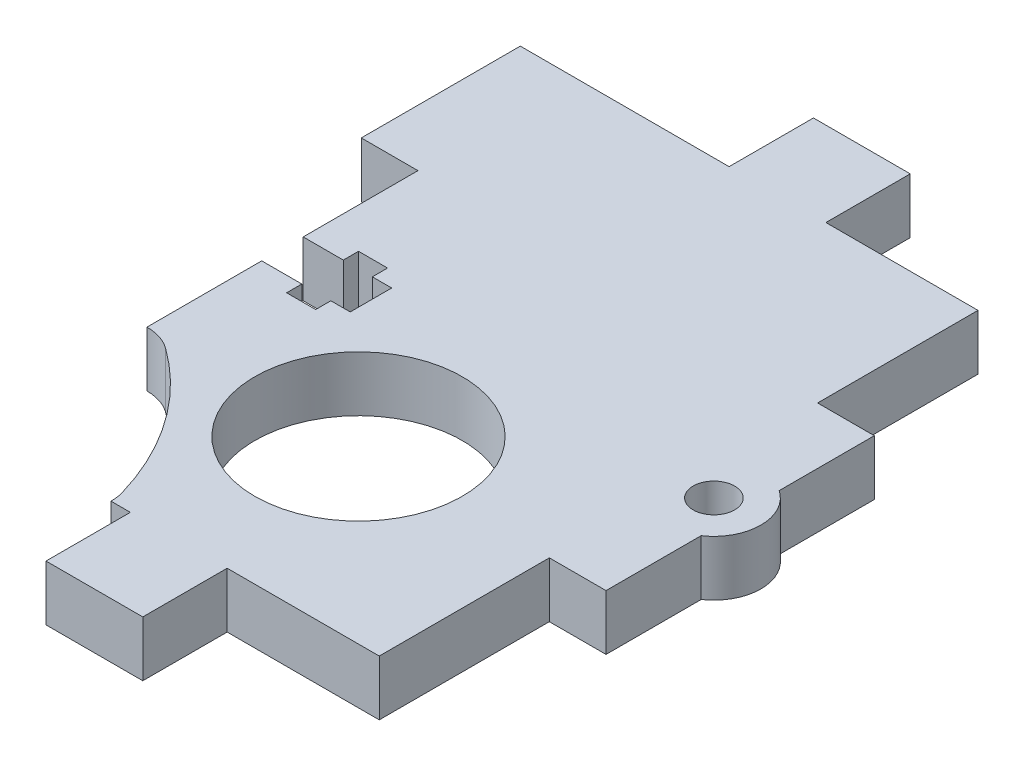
ISO-10303-21;
HEADER;
FILE_DESCRIPTION(('STEP AP214'),'2;1');
FILE_NAME('part.step','',(''),(''),'','','');
FILE_SCHEMA(('AUTOMOTIVE_DESIGN { 1 0 10303 214 1 1 1 1 }'));
ENDSEC;
DATA;
#1=APPLICATION_CONTEXT('core data for automotive mechanical design processes');
#2=APPLICATION_PROTOCOL_DEFINITION('international standard','automotive_design',2000,#1);
#3=PRODUCT_CONTEXT('',#1,'mechanical');
#4=PRODUCT('Part','Part','',(#3));
#5=PRODUCT_RELATED_PRODUCT_CATEGORY('part','',(#4));
#6=PRODUCT_DEFINITION_FORMATION('','',#4);
#7=PRODUCT_DEFINITION_CONTEXT('part definition',#1,'design');
#8=PRODUCT_DEFINITION('design','',#6,#7);
#9=PRODUCT_DEFINITION_SHAPE('','',#8);
#10=(LENGTH_UNIT() NAMED_UNIT(*) SI_UNIT(.MILLI.,.METRE.));
#11=(NAMED_UNIT(*) PLANE_ANGLE_UNIT() SI_UNIT($,.RADIAN.));
#12=(NAMED_UNIT(*) SI_UNIT($,.STERADIAN.) SOLID_ANGLE_UNIT());
#13=UNCERTAINTY_MEASURE_WITH_UNIT(LENGTH_MEASURE(1.E-05),#10,'distance_accuracy_value','');
#14=(GEOMETRIC_REPRESENTATION_CONTEXT(3) GLOBAL_UNCERTAINTY_ASSIGNED_CONTEXT((#13)) GLOBAL_UNIT_ASSIGNED_CONTEXT((#10,
#11,#12)) REPRESENTATION_CONTEXT('',''));
#15=CARTESIAN_POINT('',(0.,0.,0.));
#16=DIRECTION('',(0.,0.,1.));
#17=DIRECTION('',(1.,0.,0.));
#18=AXIS2_PLACEMENT_3D('',#15,#16,#17);
#19=CARTESIAN_POINT('',(-9.5,-2.,-2.6));
#20=DIRECTION('',(-1.,0.,0.));
#21=DIRECTION('',(0.,0.,1.));
#22=AXIS2_PLACEMENT_3D('',#19,#20,#21);
#23=PLANE('',#22);
#24=DIRECTION('',(0.,1.,0.));
#25=VECTOR('',#24,1.);
#26=CARTESIAN_POINT('',(-9.5,-2.,-2.6));
#27=LINE('',#26,#25);
#28=CARTESIAN_POINT('',(-9.5,-2.,-2.6));
#29=VERTEX_POINT('',#28);
#30=CARTESIAN_POINT('',(-9.5,2.,-2.6));
#31=VERTEX_POINT('',#30);
#32=EDGE_CURVE('E598',#29,#31,#27,.T.);
#33=ORIENTED_EDGE('',*,*,#32,.F.);
#34=DIRECTION('',(0.,0.,1.));
#35=VECTOR('',#34,1.);
#36=CARTESIAN_POINT('',(-9.5,-2.,-2.6));
#37=LINE('',#36,#35);
#38=CARTESIAN_POINT('',(-9.5,-2.,-1.5));
#39=VERTEX_POINT('',#38);
#40=EDGE_CURVE('E399',#29,#39,#37,.T.);
#41=ORIENTED_EDGE('',*,*,#40,.T.);
#42=DIRECTION('',(0.,1.,0.));
#43=VECTOR('',#42,1.);
#44=CARTESIAN_POINT('',(-9.5,-2.,-1.5));
#45=LINE('',#44,#43);
#46=CARTESIAN_POINT('',(-9.5,2.,-1.5));
#47=VERTEX_POINT('',#46);
#48=EDGE_CURVE('E389',#47,#39,#45,.F.);
#49=ORIENTED_EDGE('',*,*,#48,.F.);
#50=DIRECTION('',(0.,0.,1.));
#51=VECTOR('',#50,1.);
#52=CARTESIAN_POINT('',(-9.5,2.,0.));
#53=LINE('',#52,#51);
#54=EDGE_CURVE('E346',#31,#47,#53,.T.);
#55=ORIENTED_EDGE('',*,*,#54,.F.);
#56=EDGE_LOOP('',(#33,#41,#49,#55));
#57=FACE_BOUND('',#56,.T.);
#58=ADVANCED_FACE('F17',(#57),#23,.T.);
#59=CARTESIAN_POINT('',(-11.6,-2.,-1.5));
#60=DIRECTION('',(1.,0.,0.));
#61=DIRECTION('',(0.,0.,-1.));
#62=AXIS2_PLACEMENT_3D('',#59,#60,#61);
#63=PLANE('',#62);
#64=DIRECTION('',(0.,1.,0.));
#65=VECTOR('',#64,1.);
#66=CARTESIAN_POINT('',(-11.6,-2.,-1.5));
#67=LINE('',#66,#65);
#68=CARTESIAN_POINT('',(-11.6,-2.,-1.5));
#69=VERTEX_POINT('',#68);
#70=CARTESIAN_POINT('',(-11.6,2.,-1.5));
#71=VERTEX_POINT('',#70);
#72=EDGE_CURVE('E607',#69,#71,#67,.T.);
#73=ORIENTED_EDGE('',*,*,#72,.F.);
#74=DIRECTION('',(0.,0.,-1.));
#75=VECTOR('',#74,1.);
#76=CARTESIAN_POINT('',(-11.6,-2.,-1.5));
#77=LINE('',#76,#75);
#78=CARTESIAN_POINT('',(-11.6,-2.,-2.6));
#79=VERTEX_POINT('',#78);
#80=EDGE_CURVE('E396',#69,#79,#77,.T.);
#81=ORIENTED_EDGE('',*,*,#80,.T.);
#82=DIRECTION('',(0.,1.,0.));
#83=VECTOR('',#82,1.);
#84=CARTESIAN_POINT('',(-11.6,-2.,-2.6));
#85=LINE('',#84,#83);
#86=CARTESIAN_POINT('',(-11.6,2.,-2.6));
#87=VERTEX_POINT('',#86);
#88=EDGE_CURVE('E590',#87,#79,#85,.F.);
#89=ORIENTED_EDGE('',*,*,#88,.F.);
#90=DIRECTION('',(0.,0.,1.));
#91=VECTOR('',#90,1.);
#92=CARTESIAN_POINT('',(-11.6,2.,0.));
#93=LINE('',#92,#91);
#94=EDGE_CURVE('E341',#71,#87,#93,.F.);
#95=ORIENTED_EDGE('',*,*,#94,.F.);
#96=EDGE_LOOP('',(#73,#81,#89,#95));
#97=FACE_BOUND('',#96,.T.);
#98=ADVANCED_FACE('F833',(#97),#63,.T.);
#99=CARTESIAN_POINT('',(-8.1,-2.,1.5));
#100=DIRECTION('',(0.,0.,-1.));
#101=DIRECTION('',(-1.,0.,0.));
#102=AXIS2_PLACEMENT_3D('',#99,#100,#101);
#103=PLANE('',#102);
#104=DIRECTION('',(0.,1.,0.));
#105=VECTOR('',#104,1.);
#106=CARTESIAN_POINT('',(-8.1,-2.,1.5));
#107=LINE('',#106,#105);
#108=CARTESIAN_POINT('',(-8.1,-2.,1.5));
#109=VERTEX_POINT('',#108);
#110=CARTESIAN_POINT('',(-8.1,2.,1.5));
#111=VERTEX_POINT('',#110);
#112=EDGE_CURVE('E587',#109,#111,#107,.T.);
#113=ORIENTED_EDGE('',*,*,#112,.F.);
#114=DIRECTION('',(-1.,0.,0.));
#115=VECTOR('',#114,1.);
#116=CARTESIAN_POINT('',(-8.1,-2.,1.5));
#117=LINE('',#116,#115);
#118=CARTESIAN_POINT('',(-9.5,-2.,1.5));
#119=VERTEX_POINT('',#118);
#120=EDGE_CURVE('E393',#109,#119,#117,.T.);
#121=ORIENTED_EDGE('',*,*,#120,.T.);
#122=DIRECTION('',(0.,1.,0.));
#123=VECTOR('',#122,1.);
#124=CARTESIAN_POINT('',(-9.5,-2.,1.5));
#125=LINE('',#124,#123);
#126=CARTESIAN_POINT('',(-9.5,2.,1.5));
#127=VERTEX_POINT('',#126);
#128=EDGE_CURVE('E382',#127,#119,#125,.F.);
#129=ORIENTED_EDGE('',*,*,#128,.F.);
#130=DIRECTION('',(1.,0.,0.));
#131=VECTOR('',#130,1.);
#132=CARTESIAN_POINT('',(0.,2.,1.5));
#133=LINE('',#132,#131);
#134=EDGE_CURVE('E480',#111,#127,#133,.F.);
#135=ORIENTED_EDGE('',*,*,#134,.F.);
#136=EDGE_LOOP('',(#113,#121,#129,#135));
#137=FACE_BOUND('',#136,.T.);
#138=ADVANCED_FACE('F835',(#137),#103,.T.);
#139=CARTESIAN_POINT('',(-9.5,-2.,-1.5));
#140=DIRECTION('',(0.,0.,1.));
#141=DIRECTION('',(1.,0.,0.));
#142=AXIS2_PLACEMENT_3D('',#139,#140,#141);
#143=PLANE('',#142);
#144=ORIENTED_EDGE('',*,*,#48,.T.);
#145=DIRECTION('',(1.,0.,0.));
#146=VECTOR('',#145,1.);
#147=CARTESIAN_POINT('',(-9.5,-2.,-1.5));
#148=LINE('',#147,#146);
#149=CARTESIAN_POINT('',(-8.1,-2.,-1.5));
#150=VERTEX_POINT('',#149);
#151=EDGE_CURVE('E386',#39,#150,#148,.T.);
#152=ORIENTED_EDGE('',*,*,#151,.T.);
#153=DIRECTION('',(0.,1.,0.));
#154=VECTOR('',#153,1.);
#155=CARTESIAN_POINT('',(-8.1,-2.,-1.5));
#156=LINE('',#155,#154);
#157=CARTESIAN_POINT('',(-8.1,2.,-1.5));
#158=VERTEX_POINT('',#157);
#159=EDGE_CURVE('E406',#158,#150,#156,.F.);
#160=ORIENTED_EDGE('',*,*,#159,.F.);
#161=DIRECTION('',(1.,0.,0.));
#162=VECTOR('',#161,1.);
#163=CARTESIAN_POINT('',(0.,2.,-1.5));
#164=LINE('',#163,#162);
#165=EDGE_CURVE('E483',#47,#158,#164,.T.);
#166=ORIENTED_EDGE('',*,*,#165,.F.);
#167=EDGE_LOOP('',(#144,#152,#160,#166));
#168=FACE_BOUND('',#167,.T.);
#169=ADVANCED_FACE('F841',(#168),#143,.T.);
#170=CARTESIAN_POINT('',(-9.5,-2.,1.5));
#171=DIRECTION('',(-1.,0.,0.));
#172=DIRECTION('',(0.,0.,1.));
#173=AXIS2_PLACEMENT_3D('',#170,#171,#172);
#174=PLANE('',#173);
#175=ORIENTED_EDGE('',*,*,#128,.T.);
#176=DIRECTION('',(0.,0.,1.));
#177=VECTOR('',#176,1.);
#178=CARTESIAN_POINT('',(-9.5,-2.,1.5));
#179=LINE('',#178,#177);
#180=CARTESIAN_POINT('',(-9.5,-2.,2.6));
#181=VERTEX_POINT('',#180);
#182=EDGE_CURVE('E370',#119,#181,#179,.T.);
#183=ORIENTED_EDGE('',*,*,#182,.T.);
#184=DIRECTION('',(0.,1.,0.));
#185=VECTOR('',#184,1.);
#186=CARTESIAN_POINT('',(-9.5,-2.,2.6));
#187=LINE('',#186,#185);
#188=CARTESIAN_POINT('',(-9.5,2.,2.6));
#189=VERTEX_POINT('',#188);
#190=EDGE_CURVE('E365',#189,#181,#187,.F.);
#191=ORIENTED_EDGE('',*,*,#190,.F.);
#192=DIRECTION('',(0.,0.,1.));
#193=VECTOR('',#192,1.);
#194=CARTESIAN_POINT('',(-9.5,2.,0.));
#195=LINE('',#194,#193);
#196=EDGE_CURVE('E377',#127,#189,#195,.T.);
#197=ORIENTED_EDGE('',*,*,#196,.F.);
#198=EDGE_LOOP('',(#175,#183,#191,#197));
#199=FACE_BOUND('',#198,.T.);
#200=ADVANCED_FACE('F951',(#199),#174,.T.);
#201=CARTESIAN_POINT('',(-11.6,-2.,2.6));
#202=DIRECTION('',(1.,0.,0.));
#203=DIRECTION('',(0.,0.,-1.));
#204=AXIS2_PLACEMENT_3D('',#201,#202,#203);
#205=PLANE('',#204);
#206=DIRECTION('',(0.,1.,0.));
#207=VECTOR('',#206,1.);
#208=CARTESIAN_POINT('',(-11.6,-2.,2.6));
#209=LINE('',#208,#207);
#210=CARTESIAN_POINT('',(-11.6,-2.,2.6));
#211=VERTEX_POINT('',#210);
#212=CARTESIAN_POINT('',(-11.6,2.,2.6));
#213=VERTEX_POINT('',#212);
#214=EDGE_CURVE('E402',#211,#213,#209,.T.);
#215=ORIENTED_EDGE('',*,*,#214,.F.);
#216=DIRECTION('',(0.,0.,-1.));
#217=VECTOR('',#216,1.);
#218=CARTESIAN_POINT('',(-11.6,-2.,2.6));
#219=LINE('',#218,#217);
#220=CARTESIAN_POINT('',(-11.6,-2.,1.5));
#221=VERTEX_POINT('',#220);
#222=EDGE_CURVE('E325',#211,#221,#219,.T.);
#223=ORIENTED_EDGE('',*,*,#222,.T.);
#224=DIRECTION('',(0.,1.,0.));
#225=VECTOR('',#224,1.);
#226=CARTESIAN_POINT('',(-11.6,-2.,1.5));
#227=LINE('',#226,#225);
#228=CARTESIAN_POINT('',(-11.6,2.,1.5));
#229=VERTEX_POINT('',#228);
#230=EDGE_CURVE('E358',#229,#221,#227,.F.);
#231=ORIENTED_EDGE('',*,*,#230,.F.);
#232=DIRECTION('',(0.,0.,1.));
#233=VECTOR('',#232,1.);
#234=CARTESIAN_POINT('',(-11.6,2.,0.));
#235=LINE('',#234,#233);
#236=EDGE_CURVE('E373',#213,#229,#235,.F.);
#237=ORIENTED_EDGE('',*,*,#236,.F.);
#238=EDGE_LOOP('',(#215,#223,#231,#237));
#239=FACE_BOUND('',#238,.T.);
#240=ADVANCED_FACE('F948',(#239),#205,.T.);
#241=CARTESIAN_POINT('',(-8.3,-2.,22.));
#242=DIRECTION('',(0.,1.,0.));
#243=DIRECTION('',(0.,0.,1.));
#244=AXIS2_PLACEMENT_3D('',#241,#242,#243);
#245=CYLINDRICAL_SURFACE('',#244,3.4);
#246=CARTESIAN_POINT('',(-8.3,2.,22.));
#247=DIRECTION('',(0.,1.,0.));
#248=DIRECTION('',(0.,0.,1.));
#249=AXIS2_PLACEMENT_3D('',#246,#247,#248);
#250=CIRCLE('',#249,3.4);
#251=CARTESIAN_POINT('',(-5.03577933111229,2.,21.0487569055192));
#252=VERTEX_POINT('',#251);
#253=CARTESIAN_POINT('',(-4.9,2.,22.));
#254=VERTEX_POINT('',#253);
#255=EDGE_CURVE('E376',#252,#254,#250,.F.);
#256=ORIENTED_EDGE('',*,*,#255,.F.);
#257=DIRECTION('',(0.,1.,0.));
#258=VECTOR('',#257,1.);
#259=CARTESIAN_POINT('',(-5.03577933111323,-2.,21.0487569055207));
#260=LINE('',#259,#258);
#261=CARTESIAN_POINT('',(-5.03577933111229,-2.,21.0487569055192));
#262=VERTEX_POINT('',#261);
#263=EDGE_CURVE('E319',#252,#262,#260,.F.);
#264=ORIENTED_EDGE('',*,*,#263,.T.);
#265=CARTESIAN_POINT('',(-8.3,-2.,22.));
#266=DIRECTION('',(0.,1.,0.));
#267=DIRECTION('',(0.,0.,1.));
#268=AXIS2_PLACEMENT_3D('',#265,#266,#267);
#269=CIRCLE('',#268,3.4);
#270=CARTESIAN_POINT('',(-4.9,-2.,22.));
#271=VERTEX_POINT('',#270);
#272=EDGE_CURVE('E20',#271,#262,#269,.T.);
#273=ORIENTED_EDGE('',*,*,#272,.F.);
#274=DIRECTION('',(0.,1.,0.));
#275=VECTOR('',#274,1.);
#276=CARTESIAN_POINT('',(-4.9,-2.,22.));
#277=LINE('',#276,#275);
#278=EDGE_CURVE('E316',#254,#271,#277,.F.);
#279=ORIENTED_EDGE('',*,*,#278,.F.);
#280=EDGE_LOOP('',(#256,#264,#273,#279));
#281=FACE_BOUND('',#280,.T.);
#282=ADVANCED_FACE('F315',(#281),#245,.F.);
#283=CARTESIAN_POINT('',(-4.9,-2.,22.));
#284=DIRECTION('',(0.,0.,1.));
#285=DIRECTION('',(1.,0.,0.));
#286=AXIS2_PLACEMENT_3D('',#283,#284,#285);
#287=PLANE('',#286);
#288=ORIENTED_EDGE('',*,*,#278,.T.);
#289=DIRECTION('',(1.,0.,0.));
#290=VECTOR('',#289,1.);
#291=CARTESIAN_POINT('',(-4.9,-2.,22.));
#292=LINE('',#291,#290);
#293=CARTESIAN_POINT('',(-3.5,-2.,22.));
#294=VERTEX_POINT('',#293);
#295=EDGE_CURVE('E329',#271,#294,#292,.T.);
#296=ORIENTED_EDGE('',*,*,#295,.T.);
#297=DIRECTION('',(0.,1.,0.));
#298=VECTOR('',#297,1.);
#299=CARTESIAN_POINT('',(-3.5,-2.,22.));
#300=LINE('',#299,#298);
#301=CARTESIAN_POINT('',(-3.5,2.,22.));
#302=VERTEX_POINT('',#301);
#303=EDGE_CURVE('E544',#302,#294,#300,.F.);
#304=ORIENTED_EDGE('',*,*,#303,.F.);
#305=DIRECTION('',(1.,0.,0.));
#306=VECTOR('',#305,1.);
#307=CARTESIAN_POINT('',(0.,2.,22.));
#308=LINE('',#307,#306);
#309=EDGE_CURVE('E331',#254,#302,#308,.T.);
#310=ORIENTED_EDGE('',*,*,#309,.F.);
#311=EDGE_LOOP('',(#288,#296,#304,#310));
#312=FACE_BOUND('',#311,.T.);
#313=ADVANCED_FACE('F327',(#312),#287,.T.);
#314=CARTESIAN_POINT('',(0.,2.,0.));
#315=DIRECTION('',(0.,1.,0.));
#316=DIRECTION('',(0.,0.,1.));
#317=AXIS2_PLACEMENT_3D('',#314,#315,#316);
#318=PLANE('',#317);
#319=CARTESIAN_POINT('',(0.,2.,9.));
#320=DIRECTION('',(0.,1.,0.));
#321=DIRECTION('',(0.,0.,1.));
#322=AXIS2_PLACEMENT_3D('',#319,#320,#321);
#323=CIRCLE('',#322,7.5);
#324=CARTESIAN_POINT('',(0.,2.,16.5));
#325=VERTEX_POINT('',#324);
#326=EDGE_CURVE('E440',#325,#325,#323,.F.);
#327=ORIENTED_EDGE('',*,*,#326,.T.);
#328=EDGE_LOOP('',(#327));
#329=FACE_BOUND('',#328,.T.);
#330=CARTESIAN_POINT('',(16.7,2.,0.));
#331=DIRECTION('',(0.,1.,0.));
#332=DIRECTION('',(0.,0.,1.));
#333=AXIS2_PLACEMENT_3D('',#330,#331,#332);
#334=CIRCLE('',#333,1.5);
#335=CARTESIAN_POINT('',(16.7,2.,1.5));
#336=VERTEX_POINT('',#335);
#337=EDGE_CURVE('E445',#336,#336,#334,.F.);
#338=ORIENTED_EDGE('',*,*,#337,.T.);
#339=EDGE_LOOP('',(#338));
#340=FACE_BOUND('',#339,.T.);
#341=DIRECTION('',(-1.,0.,0.));
#342=VECTOR('',#341,1.);
#343=CARTESIAN_POINT('',(-3.5,2.,-21.3));
#344=LINE('',#343,#342);
#345=CARTESIAN_POINT('',(-18.6,2.,-21.3));
#346=VERTEX_POINT('',#345);
#347=CARTESIAN_POINT('',(-3.5,2.,-21.3));
#348=VERTEX_POINT('',#347);
#349=EDGE_CURVE('E632',#346,#348,#344,.F.);
#350=ORIENTED_EDGE('',*,*,#349,.F.);
#351=DIRECTION('',(0.,0.,1.));
#352=VECTOR('',#351,1.);
#353=CARTESIAN_POINT('',(-18.6,2.,-21.3));
#354=LINE('',#353,#352);
#355=CARTESIAN_POINT('',(-18.6,2.,-9.8));
#356=VERTEX_POINT('',#355);
#357=EDGE_CURVE('E466',#356,#346,#354,.F.);
#358=ORIENTED_EDGE('',*,*,#357,.F.);
#359=DIRECTION('',(1.,0.,0.));
#360=VECTOR('',#359,1.);
#361=CARTESIAN_POINT('',(-18.6,2.,-9.8));
#362=LINE('',#361,#360);
#363=CARTESIAN_POINT('',(-14.5,2.,-9.8));
#364=VERTEX_POINT('',#363);
#365=EDGE_CURVE('E472',#364,#356,#362,.F.);
#366=ORIENTED_EDGE('',*,*,#365,.F.);
#367=DIRECTION('',(0.,0.,1.));
#368=VECTOR('',#367,1.);
#369=CARTESIAN_POINT('',(-14.5,2.,-9.8));
#370=LINE('',#369,#368);
#371=CARTESIAN_POINT('',(-14.5,2.,-1.5));
#372=VERTEX_POINT('',#371);
#373=EDGE_CURVE('E613',#372,#364,#370,.F.);
#374=ORIENTED_EDGE('',*,*,#373,.F.);
#375=DIRECTION('',(1.,0.,0.));
#376=VECTOR('',#375,1.);
#377=CARTESIAN_POINT('',(-14.5,2.,-1.5));
#378=LINE('',#377,#376);
#379=EDGE_CURVE('E604',#71,#372,#378,.F.);
#380=ORIENTED_EDGE('',*,*,#379,.F.);
#381=ORIENTED_EDGE('',*,*,#94,.T.);
#382=DIRECTION('',(1.,0.,0.));
#383=VECTOR('',#382,1.);
#384=CARTESIAN_POINT('',(-11.6,2.,-2.6));
#385=LINE('',#384,#383);
#386=EDGE_CURVE('E594',#31,#87,#385,.F.);
#387=ORIENTED_EDGE('',*,*,#386,.F.);
#388=ORIENTED_EDGE('',*,*,#54,.T.);
#389=ORIENTED_EDGE('',*,*,#165,.T.);
#390=DIRECTION('',(0.,0.,1.));
#391=VECTOR('',#390,1.);
#392=CARTESIAN_POINT('',(-8.1,2.,-1.5));
#393=LINE('',#392,#391);
#394=EDGE_CURVE('E583',#111,#158,#393,.F.);
#395=ORIENTED_EDGE('',*,*,#394,.F.);
#396=ORIENTED_EDGE('',*,*,#134,.T.);
#397=ORIENTED_EDGE('',*,*,#196,.T.);
#398=DIRECTION('',(-1.,0.,0.));
#399=VECTOR('',#398,1.);
#400=CARTESIAN_POINT('',(-9.5,2.,2.6));
#401=LINE('',#400,#399);
#402=EDGE_CURVE('E405',#213,#189,#401,.F.);
#403=ORIENTED_EDGE('',*,*,#402,.F.);
#404=ORIENTED_EDGE('',*,*,#236,.T.);
#405=DIRECTION('',(-1.,0.,0.));
#406=VECTOR('',#405,1.);
#407=CARTESIAN_POINT('',(-11.6,2.,1.5));
#408=LINE('',#407,#406);
#409=CARTESIAN_POINT('',(-14.5,2.,1.5));
#410=VERTEX_POINT('',#409);
#411=EDGE_CURVE('E361',#410,#229,#408,.F.);
#412=ORIENTED_EDGE('',*,*,#411,.F.);
#413=DIRECTION('',(0.,0.,1.));
#414=VECTOR('',#413,1.);
#415=CARTESIAN_POINT('',(-14.5,2.,1.5));
#416=LINE('',#415,#414);
#417=CARTESIAN_POINT('',(-14.5,2.,9.8));
#418=VERTEX_POINT('',#417);
#419=EDGE_CURVE('E354',#418,#410,#416,.F.);
#420=ORIENTED_EDGE('',*,*,#419,.F.);
#421=CARTESIAN_POINT('',(-14.5,2.,13.2));
#422=DIRECTION('',(0.,1.,0.));
#423=DIRECTION('',(0.,0.,1.));
#424=AXIS2_PLACEMENT_3D('',#421,#422,#423);
#425=CIRCLE('',#424,3.4);
#426=CARTESIAN_POINT('',(-12.5056588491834,2.,10.4463472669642));
#427=VERTEX_POINT('',#426);
#428=EDGE_CURVE('E459',#418,#427,#425,.F.);
#429=ORIENTED_EDGE('',*,*,#428,.T.);
#430=CARTESIAN_POINT('',(-24.2370773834,2.,26.64430452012));
#431=DIRECTION('',(0.,1.,0.));
#432=DIRECTION('',(0.,0.,1.));
#433=AXIS2_PLACEMENT_3D('',#430,#431,#432);
#434=CIRCLE('',#433,20.);
#435=EDGE_CURVE('E454',#427,#252,#434,.F.);
#436=ORIENTED_EDGE('',*,*,#435,.T.);
#437=ORIENTED_EDGE('',*,*,#255,.T.);
#438=ORIENTED_EDGE('',*,*,#309,.T.);
#439=DIRECTION('',(0.,0.,1.));
#440=VECTOR('',#439,1.);
#441=CARTESIAN_POINT('',(-3.5,2.,22.));
#442=LINE('',#441,#440);
#443=CARTESIAN_POINT('',(-3.5,2.,28.1));
#444=VERTEX_POINT('',#443);
#445=EDGE_CURVE('E546',#444,#302,#442,.F.);
#446=ORIENTED_EDGE('',*,*,#445,.F.);
#447=DIRECTION('',(1.,0.,0.));
#448=VECTOR('',#447,1.);
#449=CARTESIAN_POINT('',(-3.5,2.,28.1));
#450=LINE('',#449,#448);
#451=CARTESIAN_POINT('',(3.5,2.,28.1));
#452=VERTEX_POINT('',#451);
#453=EDGE_CURVE('E541',#452,#444,#450,.F.);
#454=ORIENTED_EDGE('',*,*,#453,.F.);
#455=DIRECTION('',(0.,0.,-1.));
#456=VECTOR('',#455,1.);
#457=CARTESIAN_POINT('',(3.5,2.,28.1));
#458=LINE('',#457,#456);
#459=CARTESIAN_POINT('',(3.5,2.,22.));
#460=VERTEX_POINT('',#459);
#461=EDGE_CURVE('E535',#460,#452,#458,.F.);
#462=ORIENTED_EDGE('',*,*,#461,.F.);
#463=DIRECTION('',(1.,0.,0.));
#464=VECTOR('',#463,1.);
#465=CARTESIAN_POINT('',(3.5,2.,22.));
#466=LINE('',#465,#464);
#467=CARTESIAN_POINT('',(14.5,2.,22.));
#468=VERTEX_POINT('',#467);
#469=EDGE_CURVE('E529',#468,#460,#466,.F.);
#470=ORIENTED_EDGE('',*,*,#469,.F.);
#471=DIRECTION('',(0.,0.,-1.));
#472=VECTOR('',#471,1.);
#473=CARTESIAN_POINT('',(14.5,2.,22.));
#474=LINE('',#473,#472);
#475=CARTESIAN_POINT('',(14.5,2.,9.7));
#476=VERTEX_POINT('',#475);
#477=EDGE_CURVE('E523',#476,#468,#474,.F.);
#478=ORIENTED_EDGE('',*,*,#477,.F.);
#479=DIRECTION('',(1.,0.,0.));
#480=VECTOR('',#479,1.);
#481=CARTESIAN_POINT('',(14.5,2.,9.7));
#482=LINE('',#481,#480);
#483=CARTESIAN_POINT('',(18.6,2.,9.7));
#484=VERTEX_POINT('',#483);
#485=EDGE_CURVE('E517',#484,#476,#482,.F.);
#486=ORIENTED_EDGE('',*,*,#485,.F.);
#487=DIRECTION('',(0.,0.,-1.));
#488=VECTOR('',#487,1.);
#489=CARTESIAN_POINT('',(18.6,2.,9.7));
#490=LINE('',#489,#488);
#491=CARTESIAN_POINT('',(18.6000000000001,2.,2.81957443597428));
#492=VERTEX_POINT('',#491);
#493=EDGE_CURVE('E511',#492,#484,#490,.F.);
#494=ORIENTED_EDGE('',*,*,#493,.F.);
#495=CARTESIAN_POINT('',(16.7,2.,0.));
#496=DIRECTION('',(0.,1.,0.));
#497=DIRECTION('',(0.,0.,1.));
#498=AXIS2_PLACEMENT_3D('',#495,#496,#497);
#499=CIRCLE('',#498,3.4);
#500=CARTESIAN_POINT('',(18.6,2.,-2.81957443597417));
#501=VERTEX_POINT('',#500);
#502=EDGE_CURVE('E449',#501,#492,#499,.F.);
#503=ORIENTED_EDGE('',*,*,#502,.F.);
#504=DIRECTION('',(0.,0.,-1.));
#505=VECTOR('',#504,1.);
#506=CARTESIAN_POINT('',(18.6,2.,-2.819574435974));
#507=LINE('',#506,#505);
#508=CARTESIAN_POINT('',(18.6,2.,-9.7));
#509=VERTEX_POINT('',#508);
#510=EDGE_CURVE('E488',#509,#501,#507,.F.);
#511=ORIENTED_EDGE('',*,*,#510,.F.);
#512=DIRECTION('',(-1.,0.,0.));
#513=VECTOR('',#512,1.);
#514=CARTESIAN_POINT('',(18.6,2.,-9.7));
#515=LINE('',#514,#513);
#516=CARTESIAN_POINT('',(14.5,2.,-9.7));
#517=VERTEX_POINT('',#516);
#518=EDGE_CURVE('E494',#517,#509,#515,.F.);
#519=ORIENTED_EDGE('',*,*,#518,.F.);
#520=DIRECTION('',(0.,0.,-1.));
#521=VECTOR('',#520,1.);
#522=CARTESIAN_POINT('',(14.5,2.,-9.7));
#523=LINE('',#522,#521);
#524=CARTESIAN_POINT('',(14.5,2.,-21.3));
#525=VERTEX_POINT('',#524);
#526=EDGE_CURVE('E500',#525,#517,#523,.F.);
#527=ORIENTED_EDGE('',*,*,#526,.F.);
#528=DIRECTION('',(-1.,0.,0.));
#529=VECTOR('',#528,1.);
#530=CARTESIAN_POINT('',(14.5,2.,-21.3));
#531=LINE('',#530,#529);
#532=CARTESIAN_POINT('',(3.5,2.,-21.3));
#533=VERTEX_POINT('',#532);
#534=EDGE_CURVE('E508',#533,#525,#531,.F.);
#535=ORIENTED_EDGE('',*,*,#534,.F.);
#536=DIRECTION('',(0.,0.,-1.));
#537=VECTOR('',#536,1.);
#538=CARTESIAN_POINT('',(3.5,2.,-21.3));
#539=LINE('',#538,#537);
#540=CARTESIAN_POINT('',(3.5,2.,-27.4));
#541=VERTEX_POINT('',#540);
#542=EDGE_CURVE('E668',#541,#533,#539,.F.);
#543=ORIENTED_EDGE('',*,*,#542,.F.);
#544=DIRECTION('',(-1.,0.,0.));
#545=VECTOR('',#544,1.);
#546=CARTESIAN_POINT('',(3.5,2.,-27.4));
#547=LINE('',#546,#545);
#548=CARTESIAN_POINT('',(-3.5,2.,-27.4));
#549=VERTEX_POINT('',#548);
#550=EDGE_CURVE('E662',#549,#541,#547,.F.);
#551=ORIENTED_EDGE('',*,*,#550,.F.);
#552=DIRECTION('',(0.,0.,1.));
#553=VECTOR('',#552,1.);
#554=CARTESIAN_POINT('',(-3.5,2.,-27.4));
#555=LINE('',#554,#553);
#556=EDGE_CURVE('E656',#348,#549,#555,.F.);
#557=ORIENTED_EDGE('',*,*,#556,.F.);
#558=EDGE_LOOP('',(#350,#358,#366,#374,#380,#381,#387,#388,#389,#395,#396,#397,#403,#404,#412,
#420,#429,#436,#437,#438,#446,#454,#462,#470,#478,#486,#494,#503,#511,#519,#527,#535,#543,#551,#557));
#559=FACE_BOUND('',#558,.T.);
#560=ADVANCED_FACE('F630',(#329,#340,#559),#318,.T.);
#561=CARTESIAN_POINT('',(-18.6,-2.,-21.3));
#562=DIRECTION('',(-1.,0.,0.));
#563=DIRECTION('',(0.,0.,1.));
#564=AXIS2_PLACEMENT_3D('',#561,#562,#563);
#565=PLANE('',#564);
#566=DIRECTION('',(0.,1.,0.));
#567=VECTOR('',#566,1.);
#568=CARTESIAN_POINT('',(-18.6,-2.,-21.3));
#569=LINE('',#568,#567);
#570=CARTESIAN_POINT('',(-18.6,-2.,-21.3));
#571=VERTEX_POINT('',#570);
#572=EDGE_CURVE('E638',#571,#346,#569,.T.);
#573=ORIENTED_EDGE('',*,*,#572,.F.);
#574=DIRECTION('',(0.,0.,1.));
#575=VECTOR('',#574,1.);
#576=CARTESIAN_POINT('',(-18.6,-2.,0.));
#577=LINE('',#576,#575);
#578=CARTESIAN_POINT('',(-18.6,-2.,-9.8));
#579=VERTEX_POINT('',#578);
#580=EDGE_CURVE('E444',#571,#579,#577,.T.);
#581=ORIENTED_EDGE('',*,*,#580,.T.);
#582=DIRECTION('',(0.,1.,0.));
#583=VECTOR('',#582,1.);
#584=CARTESIAN_POINT('',(-18.6,-2.,-9.8));
#585=LINE('',#584,#583);
#586=EDGE_CURVE('E616',#356,#579,#585,.F.);
#587=ORIENTED_EDGE('',*,*,#586,.F.);
#588=ORIENTED_EDGE('',*,*,#357,.T.);
#589=EDGE_LOOP('',(#573,#581,#587,#588));
#590=FACE_BOUND('',#589,.T.);
#591=ADVANCED_FACE('F637',(#590),#565,.T.);
#592=CARTESIAN_POINT('',(-18.6,-2.,-9.8));
#593=DIRECTION('',(0.,0.,1.));
#594=DIRECTION('',(1.,0.,0.));
#595=AXIS2_PLACEMENT_3D('',#592,#593,#594);
#596=PLANE('',#595);
#597=ORIENTED_EDGE('',*,*,#586,.T.);
#598=DIRECTION('',(1.,0.,0.));
#599=VECTOR('',#598,1.);
#600=CARTESIAN_POINT('',(0.,-2.,-9.8));
#601=LINE('',#600,#599);
#602=CARTESIAN_POINT('',(-14.5,-2.,-9.8));
#603=VERTEX_POINT('',#602);
#604=EDGE_CURVE('E640',#579,#603,#601,.T.);
#605=ORIENTED_EDGE('',*,*,#604,.T.);
#606=DIRECTION('',(0.,1.,0.));
#607=VECTOR('',#606,1.);
#608=CARTESIAN_POINT('',(-14.5,-2.,-9.8));
#609=LINE('',#608,#607);
#610=EDGE_CURVE('E610',#364,#603,#609,.F.);
#611=ORIENTED_EDGE('',*,*,#610,.F.);
#612=ORIENTED_EDGE('',*,*,#365,.T.);
#613=EDGE_LOOP('',(#597,#605,#611,#612));
#614=FACE_BOUND('',#613,.T.);
#615=ADVANCED_FACE('F624',(#614),#596,.T.);
#616=CARTESIAN_POINT('',(-14.5,-2.,-9.8));
#617=DIRECTION('',(-1.,0.,0.));
#618=DIRECTION('',(0.,0.,1.));
#619=AXIS2_PLACEMENT_3D('',#616,#617,#618);
#620=PLANE('',#619);
#621=ORIENTED_EDGE('',*,*,#610,.T.);
#622=DIRECTION('',(0.,0.,1.));
#623=VECTOR('',#622,1.);
#624=CARTESIAN_POINT('',(-14.5,-2.,0.));
#625=LINE('',#624,#623);
#626=CARTESIAN_POINT('',(-14.5,-2.,-1.5));
#627=VERTEX_POINT('',#626);
#628=EDGE_CURVE('E643',#603,#627,#625,.T.);
#629=ORIENTED_EDGE('',*,*,#628,.T.);
#630=DIRECTION('',(0.,1.,0.));
#631=VECTOR('',#630,1.);
#632=CARTESIAN_POINT('',(-14.5,-2.,-1.5));
#633=LINE('',#632,#631);
#634=EDGE_CURVE('E601',#372,#627,#633,.F.);
#635=ORIENTED_EDGE('',*,*,#634,.F.);
#636=ORIENTED_EDGE('',*,*,#373,.T.);
#637=EDGE_LOOP('',(#621,#629,#635,#636));
#638=FACE_BOUND('',#637,.T.);
#639=ADVANCED_FACE('F818',(#638),#620,.T.);
#640=CARTESIAN_POINT('',(-14.5,-2.,-1.5));
#641=DIRECTION('',(0.,0.,1.));
#642=DIRECTION('',(1.,0.,0.));
#643=AXIS2_PLACEMENT_3D('',#640,#641,#642);
#644=PLANE('',#643);
#645=ORIENTED_EDGE('',*,*,#634,.T.);
#646=DIRECTION('',(1.,0.,0.));
#647=VECTOR('',#646,1.);
#648=CARTESIAN_POINT('',(0.,-2.,-1.5));
#649=LINE('',#648,#647);
#650=EDGE_CURVE('E810',#627,#69,#649,.T.);
#651=ORIENTED_EDGE('',*,*,#650,.T.);
#652=ORIENTED_EDGE('',*,*,#72,.T.);
#653=ORIENTED_EDGE('',*,*,#379,.T.);
#654=EDGE_LOOP('',(#645,#651,#652,#653));
#655=FACE_BOUND('',#654,.T.);
#656=ADVANCED_FACE('F823',(#655),#644,.T.);
#657=CARTESIAN_POINT('',(-11.6,-2.,-2.6));
#658=DIRECTION('',(0.,0.,1.));
#659=DIRECTION('',(1.,0.,0.));
#660=AXIS2_PLACEMENT_3D('',#657,#658,#659);
#661=PLANE('',#660);
#662=ORIENTED_EDGE('',*,*,#88,.T.);
#663=DIRECTION('',(1.,0.,0.));
#664=VECTOR('',#663,1.);
#665=CARTESIAN_POINT('',(0.,-2.,-2.6));
#666=LINE('',#665,#664);
#667=EDGE_CURVE('E806',#79,#29,#666,.T.);
#668=ORIENTED_EDGE('',*,*,#667,.T.);
#669=ORIENTED_EDGE('',*,*,#32,.T.);
#670=ORIENTED_EDGE('',*,*,#386,.T.);
#671=EDGE_LOOP('',(#662,#668,#669,#670));
#672=FACE_BOUND('',#671,.T.);
#673=ADVANCED_FACE('F830',(#672),#661,.T.);
#674=CARTESIAN_POINT('',(-8.1,-2.,-1.5));
#675=DIRECTION('',(-1.,0.,0.));
#676=DIRECTION('',(0.,0.,1.));
#677=AXIS2_PLACEMENT_3D('',#674,#675,#676);
#678=PLANE('',#677);
#679=ORIENTED_EDGE('',*,*,#159,.T.);
#680=DIRECTION('',(0.,0.,1.));
#681=VECTOR('',#680,1.);
#682=CARTESIAN_POINT('',(-8.1,-2.,0.));
#683=LINE('',#682,#681);
#684=EDGE_CURVE('E419',#150,#109,#683,.T.);
#685=ORIENTED_EDGE('',*,*,#684,.T.);
#686=ORIENTED_EDGE('',*,*,#112,.T.);
#687=ORIENTED_EDGE('',*,*,#394,.T.);
#688=EDGE_LOOP('',(#679,#685,#686,#687));
#689=FACE_BOUND('',#688,.T.);
#690=ADVANCED_FACE('F926',(#689),#678,.T.);
#691=CARTESIAN_POINT('',(-9.5,-2.,2.6));
#692=DIRECTION('',(0.,0.,-1.));
#693=DIRECTION('',(-1.,0.,0.));
#694=AXIS2_PLACEMENT_3D('',#691,#692,#693);
#695=PLANE('',#694);
#696=ORIENTED_EDGE('',*,*,#190,.T.);
#697=DIRECTION('',(1.,0.,0.));
#698=VECTOR('',#697,1.);
#699=CARTESIAN_POINT('',(0.,-2.,2.6));
#700=LINE('',#699,#698);
#701=EDGE_CURVE('E414',#181,#211,#700,.F.);
#702=ORIENTED_EDGE('',*,*,#701,.T.);
#703=ORIENTED_EDGE('',*,*,#214,.T.);
#704=ORIENTED_EDGE('',*,*,#402,.T.);
#705=EDGE_LOOP('',(#696,#702,#703,#704));
#706=FACE_BOUND('',#705,.T.);
#707=ADVANCED_FACE('F922',(#706),#695,.T.);
#708=CARTESIAN_POINT('',(-11.6,-2.,1.5));
#709=DIRECTION('',(0.,0.,-1.));
#710=DIRECTION('',(-1.,0.,0.));
#711=AXIS2_PLACEMENT_3D('',#708,#709,#710);
#712=PLANE('',#711);
#713=ORIENTED_EDGE('',*,*,#230,.T.);
#714=DIRECTION('',(1.,0.,0.));
#715=VECTOR('',#714,1.);
#716=CARTESIAN_POINT('',(0.,-2.,1.5));
#717=LINE('',#716,#715);
#718=CARTESIAN_POINT('',(-14.5,-2.,1.5));
#719=VERTEX_POINT('',#718);
#720=EDGE_CURVE('E418',#221,#719,#717,.F.);
#721=ORIENTED_EDGE('',*,*,#720,.T.);
#722=DIRECTION('',(0.,1.,0.));
#723=VECTOR('',#722,1.);
#724=CARTESIAN_POINT('',(-14.5,-2.,1.5));
#725=LINE('',#724,#723);
#726=EDGE_CURVE('E357',#410,#719,#725,.F.);
#727=ORIENTED_EDGE('',*,*,#726,.F.);
#728=ORIENTED_EDGE('',*,*,#411,.T.);
#729=EDGE_LOOP('',(#713,#721,#727,#728));
#730=FACE_BOUND('',#729,.T.);
#731=ADVANCED_FACE('F918',(#730),#712,.T.);
#732=CARTESIAN_POINT('',(-14.5,-2.,1.5));
#733=DIRECTION('',(-1.,0.,0.));
#734=DIRECTION('',(0.,0.,1.));
#735=AXIS2_PLACEMENT_3D('',#732,#733,#734);
#736=PLANE('',#735);
#737=ORIENTED_EDGE('',*,*,#726,.T.);
#738=DIRECTION('',(0.,0.,1.));
#739=VECTOR('',#738,1.);
#740=CARTESIAN_POINT('',(-14.5,-2.,0.));
#741=LINE('',#740,#739);
#742=CARTESIAN_POINT('',(-14.5,-2.,9.8));
#743=VERTEX_POINT('',#742);
#744=EDGE_CURVE('E439',#719,#743,#741,.T.);
#745=ORIENTED_EDGE('',*,*,#744,.T.);
#746=DIRECTION('',(0.,1.,0.));
#747=VECTOR('',#746,1.);
#748=CARTESIAN_POINT('',(-14.5,-2.,9.8));
#749=LINE('',#748,#747);
#750=EDGE_CURVE('E461',#743,#418,#749,.T.);
#751=ORIENTED_EDGE('',*,*,#750,.T.);
#752=ORIENTED_EDGE('',*,*,#419,.T.);
#753=EDGE_LOOP('',(#737,#745,#751,#752));
#754=FACE_BOUND('',#753,.T.);
#755=ADVANCED_FACE('F914',(#754),#736,.T.);
#756=CARTESIAN_POINT('',(-14.5,-2.,13.2));
#757=DIRECTION('',(0.,1.,0.));
#758=DIRECTION('',(0.,0.,1.));
#759=AXIS2_PLACEMENT_3D('',#756,#757,#758);
#760=CYLINDRICAL_SURFACE('',#759,3.4);
#761=ORIENTED_EDGE('',*,*,#428,.F.);
#762=ORIENTED_EDGE('',*,*,#750,.F.);
#763=CARTESIAN_POINT('',(-14.5,-2.,13.2));
#764=DIRECTION('',(0.,1.,0.));
#765=DIRECTION('',(0.,0.,1.));
#766=AXIS2_PLACEMENT_3D('',#763,#764,#765);
#767=CIRCLE('',#766,3.4);
#768=CARTESIAN_POINT('',(-12.5056588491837,-2.,10.4463472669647));
#769=VERTEX_POINT('',#768);
#770=EDGE_CURVE('E435',#743,#769,#767,.F.);
#771=ORIENTED_EDGE('',*,*,#770,.T.);
#772=DIRECTION('',(0.,1.,0.));
#773=VECTOR('',#772,1.);
#774=CARTESIAN_POINT('',(-12.5056588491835,-2.,10.4463472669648));
#775=LINE('',#774,#773);
#776=EDGE_CURVE('E458',#769,#427,#775,.T.);
#777=ORIENTED_EDGE('',*,*,#776,.T.);
#778=EDGE_LOOP('',(#761,#762,#771,#777));
#779=FACE_BOUND('',#778,.T.);
#780=ADVANCED_FACE('F910',(#779),#760,.F.);
#781=CARTESIAN_POINT('',(-24.2370773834,-2.,26.64430452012));
#782=DIRECTION('',(0.,1.,0.));
#783=DIRECTION('',(0.,0.,1.));
#784=AXIS2_PLACEMENT_3D('',#781,#782,#783);
#785=CYLINDRICAL_SURFACE('',#784,20.);
#786=ORIENTED_EDGE('',*,*,#435,.F.);
#787=ORIENTED_EDGE('',*,*,#776,.F.);
#788=CARTESIAN_POINT('',(-24.2370773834,-2.,26.64430452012));
#789=DIRECTION('',(0.,1.,0.));
#790=DIRECTION('',(0.,0.,1.));
#791=AXIS2_PLACEMENT_3D('',#788,#789,#790);
#792=CIRCLE('',#791,20.);
#793=EDGE_CURVE('E432',#769,#262,#792,.F.);
#794=ORIENTED_EDGE('',*,*,#793,.T.);
#795=ORIENTED_EDGE('',*,*,#263,.F.);
#796=EDGE_LOOP('',(#786,#787,#794,#795));
#797=FACE_BOUND('',#796,.T.);
#798=ADVANCED_FACE('F907',(#797),#785,.F.);
#799=CARTESIAN_POINT('',(-3.5,-2.,22.));
#800=DIRECTION('',(-1.,0.,0.));
#801=DIRECTION('',(0.,0.,1.));
#802=AXIS2_PLACEMENT_3D('',#799,#800,#801);
#803=PLANE('',#802);
#804=ORIENTED_EDGE('',*,*,#303,.T.);
#805=DIRECTION('',(0.,0.,1.));
#806=VECTOR('',#805,1.);
#807=CARTESIAN_POINT('',(-3.5,-2.,0.));
#808=LINE('',#807,#806);
#809=CARTESIAN_POINT('',(-3.5,-2.,28.1));
#810=VERTEX_POINT('',#809);
#811=EDGE_CURVE('E339',#294,#810,#808,.T.);
#812=ORIENTED_EDGE('',*,*,#811,.T.);
#813=DIRECTION('',(0.,1.,0.));
#814=VECTOR('',#813,1.);
#815=CARTESIAN_POINT('',(-3.5,-2.,28.1));
#816=LINE('',#815,#814);
#817=EDGE_CURVE('E538',#444,#810,#816,.F.);
#818=ORIENTED_EDGE('',*,*,#817,.F.);
#819=ORIENTED_EDGE('',*,*,#445,.T.);
#820=EDGE_LOOP('',(#804,#812,#818,#819));
#821=FACE_BOUND('',#820,.T.);
#822=ADVANCED_FACE('F744',(#821),#803,.T.);
#823=CARTESIAN_POINT('',(-3.5,-2.,28.1));
#824=DIRECTION('',(0.,0.,1.));
#825=DIRECTION('',(1.,0.,0.));
#826=AXIS2_PLACEMENT_3D('',#823,#824,#825);
#827=PLANE('',#826);
#828=ORIENTED_EDGE('',*,*,#817,.T.);
#829=DIRECTION('',(1.,0.,0.));
#830=VECTOR('',#829,1.);
#831=CARTESIAN_POINT('',(0.,-2.,28.1));
#832=LINE('',#831,#830);
#833=CARTESIAN_POINT('',(3.5,-2.,28.1));
#834=VERTEX_POINT('',#833);
#835=EDGE_CURVE('E726',#810,#834,#832,.T.);
#836=ORIENTED_EDGE('',*,*,#835,.T.);
#837=DIRECTION('',(0.,1.,0.));
#838=VECTOR('',#837,1.);
#839=CARTESIAN_POINT('',(3.5,-2.,28.1));
#840=LINE('',#839,#838);
#841=EDGE_CURVE('E532',#452,#834,#840,.F.);
#842=ORIENTED_EDGE('',*,*,#841,.F.);
#843=ORIENTED_EDGE('',*,*,#453,.T.);
#844=EDGE_LOOP('',(#828,#836,#842,#843));
#845=FACE_BOUND('',#844,.T.);
#846=ADVANCED_FACE('F746',(#845),#827,.T.);
#847=CARTESIAN_POINT('',(3.5,-2.,28.1));
#848=DIRECTION('',(1.,0.,0.));
#849=DIRECTION('',(0.,0.,-1.));
#850=AXIS2_PLACEMENT_3D('',#847,#848,#849);
#851=PLANE('',#850);
#852=ORIENTED_EDGE('',*,*,#841,.T.);
#853=DIRECTION('',(0.,0.,1.));
#854=VECTOR('',#853,1.);
#855=CARTESIAN_POINT('',(3.5,-2.,0.));
#856=LINE('',#855,#854);
#857=CARTESIAN_POINT('',(3.5,-2.,22.));
#858=VERTEX_POINT('',#857);
#859=EDGE_CURVE('E718',#834,#858,#856,.F.);
#860=ORIENTED_EDGE('',*,*,#859,.T.);
#861=DIRECTION('',(0.,1.,0.));
#862=VECTOR('',#861,1.);
#863=CARTESIAN_POINT('',(3.5,-2.,22.));
#864=LINE('',#863,#862);
#865=EDGE_CURVE('E526',#460,#858,#864,.F.);
#866=ORIENTED_EDGE('',*,*,#865,.F.);
#867=ORIENTED_EDGE('',*,*,#461,.T.);
#868=EDGE_LOOP('',(#852,#860,#866,#867));
#869=FACE_BOUND('',#868,.T.);
#870=ADVANCED_FACE('F754',(#869),#851,.T.);
#871=CARTESIAN_POINT('',(3.5,-2.,22.));
#872=DIRECTION('',(0.,0.,1.));
#873=DIRECTION('',(1.,0.,0.));
#874=AXIS2_PLACEMENT_3D('',#871,#872,#873);
#875=PLANE('',#874);
#876=ORIENTED_EDGE('',*,*,#865,.T.);
#877=DIRECTION('',(1.,0.,0.));
#878=VECTOR('',#877,1.);
#879=CARTESIAN_POINT('',(0.,-2.,22.));
#880=LINE('',#879,#878);
#881=CARTESIAN_POINT('',(14.5,-2.,22.));
#882=VERTEX_POINT('',#881);
#883=EDGE_CURVE('E708',#858,#882,#880,.T.);
#884=ORIENTED_EDGE('',*,*,#883,.T.);
#885=DIRECTION('',(0.,1.,0.));
#886=VECTOR('',#885,1.);
#887=CARTESIAN_POINT('',(14.5,-2.,22.));
#888=LINE('',#887,#886);
#889=EDGE_CURVE('E520',#468,#882,#888,.F.);
#890=ORIENTED_EDGE('',*,*,#889,.F.);
#891=ORIENTED_EDGE('',*,*,#469,.T.);
#892=EDGE_LOOP('',(#876,#884,#890,#891));
#893=FACE_BOUND('',#892,.T.);
#894=ADVANCED_FACE('F762',(#893),#875,.T.);
#895=CARTESIAN_POINT('',(14.5,-2.,22.));
#896=DIRECTION('',(1.,0.,0.));
#897=DIRECTION('',(0.,0.,-1.));
#898=AXIS2_PLACEMENT_3D('',#895,#896,#897);
#899=PLANE('',#898);
#900=ORIENTED_EDGE('',*,*,#889,.T.);
#901=DIRECTION('',(0.,0.,1.));
#902=VECTOR('',#901,1.);
#903=CARTESIAN_POINT('',(14.5,-2.,0.));
#904=LINE('',#903,#902);
#905=CARTESIAN_POINT('',(14.5,-2.,9.7));
#906=VERTEX_POINT('',#905);
#907=EDGE_CURVE('E698',#882,#906,#904,.F.);
#908=ORIENTED_EDGE('',*,*,#907,.T.);
#909=DIRECTION('',(0.,1.,0.));
#910=VECTOR('',#909,1.);
#911=CARTESIAN_POINT('',(14.5,-2.,9.7));
#912=LINE('',#911,#910);
#913=EDGE_CURVE('E514',#476,#906,#912,.F.);
#914=ORIENTED_EDGE('',*,*,#913,.F.);
#915=ORIENTED_EDGE('',*,*,#477,.T.);
#916=EDGE_LOOP('',(#900,#908,#914,#915));
#917=FACE_BOUND('',#916,.T.);
#918=ADVANCED_FACE('F764',(#917),#899,.T.);
#919=CARTESIAN_POINT('',(14.5,-2.,9.7));
#920=DIRECTION('',(0.,0.,1.));
#921=DIRECTION('',(1.,0.,0.));
#922=AXIS2_PLACEMENT_3D('',#919,#920,#921);
#923=PLANE('',#922);
#924=ORIENTED_EDGE('',*,*,#913,.T.);
#925=DIRECTION('',(1.,0.,0.));
#926=VECTOR('',#925,1.);
#927=CARTESIAN_POINT('',(0.,-2.,9.7));
#928=LINE('',#927,#926);
#929=CARTESIAN_POINT('',(18.6,-2.,9.7));
#930=VERTEX_POINT('',#929);
#931=EDGE_CURVE('E694',#906,#930,#928,.T.);
#932=ORIENTED_EDGE('',*,*,#931,.T.);
#933=DIRECTION('',(0.,1.,0.));
#934=VECTOR('',#933,1.);
#935=CARTESIAN_POINT('',(18.6,-2.,9.7));
#936=LINE('',#935,#934);
#937=EDGE_CURVE('E453',#484,#930,#936,.F.);
#938=ORIENTED_EDGE('',*,*,#937,.F.);
#939=ORIENTED_EDGE('',*,*,#485,.T.);
#940=EDGE_LOOP('',(#924,#932,#938,#939));
#941=FACE_BOUND('',#940,.T.);
#942=ADVANCED_FACE('F771',(#941),#923,.T.);
#943=CARTESIAN_POINT('',(18.6,-2.,9.7));
#944=DIRECTION('',(1.,0.,0.));
#945=DIRECTION('',(0.,0.,-1.));
#946=AXIS2_PLACEMENT_3D('',#943,#944,#945);
#947=PLANE('',#946);
#948=ORIENTED_EDGE('',*,*,#937,.T.);
#949=DIRECTION('',(0.,0.,1.));
#950=VECTOR('',#949,1.);
#951=CARTESIAN_POINT('',(18.6,-2.,0.));
#952=LINE('',#951,#950);
#953=CARTESIAN_POINT('',(18.6000000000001,-2.,2.81957443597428));
#954=VERTEX_POINT('',#953);
#955=EDGE_CURVE('E431',#930,#954,#952,.F.);
#956=ORIENTED_EDGE('',*,*,#955,.T.);
#957=DIRECTION('',(0.,1.,0.));
#958=VECTOR('',#957,1.);
#959=CARTESIAN_POINT('',(18.6000000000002,-2.,2.81957443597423));
#960=LINE('',#959,#958);
#961=EDGE_CURVE('E452',#492,#954,#960,.F.);
#962=ORIENTED_EDGE('',*,*,#961,.F.);
#963=ORIENTED_EDGE('',*,*,#493,.T.);
#964=EDGE_LOOP('',(#948,#956,#962,#963));
#965=FACE_BOUND('',#964,.T.);
#966=ADVANCED_FACE('F778',(#965),#947,.T.);
#967=CARTESIAN_POINT('',(16.7,-2.,0.));
#968=DIRECTION('',(0.,1.,0.));
#969=DIRECTION('',(0.,0.,1.));
#970=AXIS2_PLACEMENT_3D('',#967,#968,#969);
#971=CYLINDRICAL_SURFACE('',#970,3.4);
#972=ORIENTED_EDGE('',*,*,#961,.T.);
#973=CARTESIAN_POINT('',(16.7,-2.,0.));
#974=DIRECTION('',(0.,1.,0.));
#975=DIRECTION('',(0.,0.,1.));
#976=AXIS2_PLACEMENT_3D('',#973,#974,#975);
#977=CIRCLE('',#976,3.4);
#978=CARTESIAN_POINT('',(18.6,-2.,-2.81957443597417));
#979=VERTEX_POINT('',#978);
#980=EDGE_CURVE('E426',#954,#979,#977,.T.);
#981=ORIENTED_EDGE('',*,*,#980,.T.);
#982=DIRECTION('',(0.,1.,0.));
#983=VECTOR('',#982,1.);
#984=CARTESIAN_POINT('',(18.6,-2.,-2.819574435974));
#985=LINE('',#984,#983);
#986=EDGE_CURVE('E491',#501,#979,#985,.F.);
#987=ORIENTED_EDGE('',*,*,#986,.F.);
#988=ORIENTED_EDGE('',*,*,#502,.T.);
#989=EDGE_LOOP('',(#972,#981,#987,#988));
#990=FACE_BOUND('',#989,.T.);
#991=ADVANCED_FACE('F780',(#990),#971,.T.);
#992=CARTESIAN_POINT('',(18.6,-2.,-2.819574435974));
#993=DIRECTION('',(1.,0.,0.));
#994=DIRECTION('',(0.,0.,-1.));
#995=AXIS2_PLACEMENT_3D('',#992,#993,#994);
#996=PLANE('',#995);
#997=ORIENTED_EDGE('',*,*,#986,.T.);
#998=DIRECTION('',(0.,0.,1.));
#999=VECTOR('',#998,1.);
#1000=CARTESIAN_POINT('',(18.6,-2.,0.));
#1001=LINE('',#1000,#999);
#1002=CARTESIAN_POINT('',(18.6,-2.,-9.7));
#1003=VERTEX_POINT('',#1002);
#1004=EDGE_CURVE('E430',#979,#1003,#1001,.F.);
#1005=ORIENTED_EDGE('',*,*,#1004,.T.);
#1006=DIRECTION('',(0.,1.,0.));
#1007=VECTOR('',#1006,1.);
#1008=CARTESIAN_POINT('',(18.6,-2.,-9.7));
#1009=LINE('',#1008,#1007);
#1010=EDGE_CURVE('E497',#509,#1003,#1009,.F.);
#1011=ORIENTED_EDGE('',*,*,#1010,.F.);
#1012=ORIENTED_EDGE('',*,*,#510,.T.);
#1013=EDGE_LOOP('',(#997,#1005,#1011,#1012));
#1014=FACE_BOUND('',#1013,.T.);
#1015=ADVANCED_FACE('F887',(#1014),#996,.T.);
#1016=CARTESIAN_POINT('',(18.6,-2.,-9.7));
#1017=DIRECTION('',(0.,0.,-1.));
#1018=DIRECTION('',(-1.,0.,0.));
#1019=AXIS2_PLACEMENT_3D('',#1016,#1017,#1018);
#1020=PLANE('',#1019);
#1021=ORIENTED_EDGE('',*,*,#1010,.T.);
#1022=DIRECTION('',(1.,0.,0.));
#1023=VECTOR('',#1022,1.);
#1024=CARTESIAN_POINT('',(0.,-2.,-9.7));
#1025=LINE('',#1024,#1023);
#1026=CARTESIAN_POINT('',(14.5,-2.,-9.7));
#1027=VERTEX_POINT('',#1026);
#1028=EDGE_CURVE('E678',#1003,#1027,#1025,.F.);
#1029=ORIENTED_EDGE('',*,*,#1028,.T.);
#1030=DIRECTION('',(0.,1.,0.));
#1031=VECTOR('',#1030,1.);
#1032=CARTESIAN_POINT('',(14.5,-2.,-9.7));
#1033=LINE('',#1032,#1031);
#1034=EDGE_CURVE('E503',#517,#1027,#1033,.F.);
#1035=ORIENTED_EDGE('',*,*,#1034,.F.);
#1036=ORIENTED_EDGE('',*,*,#518,.T.);
#1037=EDGE_LOOP('',(#1021,#1029,#1035,#1036));
#1038=FACE_BOUND('',#1037,.T.);
#1039=ADVANCED_FACE('F883',(#1038),#1020,.T.);
#1040=CARTESIAN_POINT('',(14.5,-2.,-9.7));
#1041=DIRECTION('',(1.,0.,0.));
#1042=DIRECTION('',(0.,0.,-1.));
#1043=AXIS2_PLACEMENT_3D('',#1040,#1041,#1042);
#1044=PLANE('',#1043);
#1045=ORIENTED_EDGE('',*,*,#1034,.T.);
#1046=DIRECTION('',(0.,0.,1.));
#1047=VECTOR('',#1046,1.);
#1048=CARTESIAN_POINT('',(14.5,-2.,0.));
#1049=LINE('',#1048,#1047);
#1050=CARTESIAN_POINT('',(14.5,-2.,-21.3));
#1051=VERTEX_POINT('',#1050);
#1052=EDGE_CURVE('E682',#1027,#1051,#1049,.F.);
#1053=ORIENTED_EDGE('',*,*,#1052,.T.);
#1054=DIRECTION('',(0.,1.,0.));
#1055=VECTOR('',#1054,1.);
#1056=CARTESIAN_POINT('',(14.5,-2.,-21.3));
#1057=LINE('',#1056,#1055);
#1058=EDGE_CURVE('E671',#525,#1051,#1057,.F.);
#1059=ORIENTED_EDGE('',*,*,#1058,.F.);
#1060=ORIENTED_EDGE('',*,*,#526,.T.);
#1061=EDGE_LOOP('',(#1045,#1053,#1059,#1060));
#1062=FACE_BOUND('',#1061,.T.);
#1063=ADVANCED_FACE('F879',(#1062),#1044,.T.);
#1064=CARTESIAN_POINT('',(14.5,-2.,-21.3));
#1065=DIRECTION('',(0.,0.,-1.));
#1066=DIRECTION('',(-1.,0.,0.));
#1067=AXIS2_PLACEMENT_3D('',#1064,#1065,#1066);
#1068=PLANE('',#1067);
#1069=ORIENTED_EDGE('',*,*,#1058,.T.);
#1070=DIRECTION('',(1.,0.,0.));
#1071=VECTOR('',#1070,1.);
#1072=CARTESIAN_POINT('',(0.,-2.,-21.3));
#1073=LINE('',#1072,#1071);
#1074=CARTESIAN_POINT('',(3.5,-2.,-21.3));
#1075=VERTEX_POINT('',#1074);
#1076=EDGE_CURVE('E1163',#1051,#1075,#1073,.F.);
#1077=ORIENTED_EDGE('',*,*,#1076,.T.);
#1078=DIRECTION('',(0.,1.,0.));
#1079=VECTOR('',#1078,1.);
#1080=CARTESIAN_POINT('',(3.5,-2.,-21.3));
#1081=LINE('',#1080,#1079);
#1082=EDGE_CURVE('E665',#533,#1075,#1081,.F.);
#1083=ORIENTED_EDGE('',*,*,#1082,.F.);
#1084=ORIENTED_EDGE('',*,*,#534,.T.);
#1085=EDGE_LOOP('',(#1069,#1077,#1083,#1084));
#1086=FACE_BOUND('',#1085,.T.);
#1087=ADVANCED_FACE('F875',(#1086),#1068,.T.);
#1088=CARTESIAN_POINT('',(3.5,-2.,-21.3));
#1089=DIRECTION('',(1.,0.,0.));
#1090=DIRECTION('',(0.,0.,-1.));
#1091=AXIS2_PLACEMENT_3D('',#1088,#1089,#1090);
#1092=PLANE('',#1091);
#1093=ORIENTED_EDGE('',*,*,#1082,.T.);
#1094=DIRECTION('',(0.,0.,1.));
#1095=VECTOR('',#1094,1.);
#1096=CARTESIAN_POINT('',(3.5,-2.,0.));
#1097=LINE('',#1096,#1095);
#1098=CARTESIAN_POINT('',(3.5,-2.,-27.4));
#1099=VERTEX_POINT('',#1098);
#1100=EDGE_CURVE('E1166',#1075,#1099,#1097,.F.);
#1101=ORIENTED_EDGE('',*,*,#1100,.T.);
#1102=DIRECTION('',(0.,1.,0.));
#1103=VECTOR('',#1102,1.);
#1104=CARTESIAN_POINT('',(3.5,-2.,-27.4));
#1105=LINE('',#1104,#1103);
#1106=EDGE_CURVE('E659',#541,#1099,#1105,.F.);
#1107=ORIENTED_EDGE('',*,*,#1106,.F.);
#1108=ORIENTED_EDGE('',*,*,#542,.T.);
#1109=EDGE_LOOP('',(#1093,#1101,#1107,#1108));
#1110=FACE_BOUND('',#1109,.T.);
#1111=ADVANCED_FACE('F871',(#1110),#1092,.T.);
#1112=CARTESIAN_POINT('',(3.5,-2.,-27.4));
#1113=DIRECTION('',(0.,0.,-1.));
#1114=DIRECTION('',(-1.,0.,0.));
#1115=AXIS2_PLACEMENT_3D('',#1112,#1113,#1114);
#1116=PLANE('',#1115);
#1117=ORIENTED_EDGE('',*,*,#1106,.T.);
#1118=DIRECTION('',(1.,0.,0.));
#1119=VECTOR('',#1118,1.);
#1120=CARTESIAN_POINT('',(0.,-2.,-27.4));
#1121=LINE('',#1120,#1119);
#1122=CARTESIAN_POINT('',(-3.5,-2.,-27.4));
#1123=VERTEX_POINT('',#1122);
#1124=EDGE_CURVE('E1170',#1099,#1123,#1121,.F.);
#1125=ORIENTED_EDGE('',*,*,#1124,.T.);
#1126=DIRECTION('',(0.,1.,0.));
#1127=VECTOR('',#1126,1.);
#1128=CARTESIAN_POINT('',(-3.5,-2.,-27.4));
#1129=LINE('',#1128,#1127);
#1130=EDGE_CURVE('E653',#549,#1123,#1129,.F.);
#1131=ORIENTED_EDGE('',*,*,#1130,.F.);
#1132=ORIENTED_EDGE('',*,*,#550,.T.);
#1133=EDGE_LOOP('',(#1117,#1125,#1131,#1132));
#1134=FACE_BOUND('',#1133,.T.);
#1135=ADVANCED_FACE('F867',(#1134),#1116,.T.);
#1136=CARTESIAN_POINT('',(-3.5,-2.,-27.4));
#1137=DIRECTION('',(-1.,0.,0.));
#1138=DIRECTION('',(0.,0.,1.));
#1139=AXIS2_PLACEMENT_3D('',#1136,#1137,#1138);
#1140=PLANE('',#1139);
#1141=ORIENTED_EDGE('',*,*,#1130,.T.);
#1142=DIRECTION('',(0.,0.,1.));
#1143=VECTOR('',#1142,1.);
#1144=CARTESIAN_POINT('',(-3.5,-2.,0.));
#1145=LINE('',#1144,#1143);
#1146=CARTESIAN_POINT('',(-3.5,-2.,-21.3));
#1147=VERTEX_POINT('',#1146);
#1148=EDGE_CURVE('E1176',#1123,#1147,#1145,.T.);
#1149=ORIENTED_EDGE('',*,*,#1148,.T.);
#1150=DIRECTION('',(0.,1.,0.));
#1151=VECTOR('',#1150,1.);
#1152=CARTESIAN_POINT('',(-3.5,-2.,-21.3));
#1153=LINE('',#1152,#1151);
#1154=EDGE_CURVE('E40',#348,#1147,#1153,.F.);
#1155=ORIENTED_EDGE('',*,*,#1154,.F.);
#1156=ORIENTED_EDGE('',*,*,#556,.T.);
#1157=EDGE_LOOP('',(#1141,#1149,#1155,#1156));
#1158=FACE_BOUND('',#1157,.T.);
#1159=ADVANCED_FACE('F864',(#1158),#1140,.T.);
#1160=CARTESIAN_POINT('',(-3.5,-2.,-21.3));
#1161=DIRECTION('',(0.,0.,-1.));
#1162=DIRECTION('',(-1.,0.,0.));
#1163=AXIS2_PLACEMENT_3D('',#1160,#1161,#1162);
#1164=PLANE('',#1163);
#1165=ORIENTED_EDGE('',*,*,#1154,.T.);
#1166=DIRECTION('',(1.,0.,0.));
#1167=VECTOR('',#1166,1.);
#1168=CARTESIAN_POINT('',(0.,-2.,-21.3));
#1169=LINE('',#1168,#1167);
#1170=EDGE_CURVE('E425',#1147,#571,#1169,.F.);
#1171=ORIENTED_EDGE('',*,*,#1170,.T.);
#1172=ORIENTED_EDGE('',*,*,#572,.T.);
#1173=ORIENTED_EDGE('',*,*,#349,.T.);
#1174=EDGE_LOOP('',(#1165,#1171,#1172,#1173));
#1175=FACE_BOUND('',#1174,.T.);
#1176=ADVANCED_FACE('F860',(#1175),#1164,.T.);
#1177=CARTESIAN_POINT('',(16.7,-2.,0.));
#1178=DIRECTION('',(0.,1.,0.));
#1179=DIRECTION('',(0.,0.,1.));
#1180=AXIS2_PLACEMENT_3D('',#1177,#1178,#1179);
#1181=CYLINDRICAL_SURFACE('',#1180,1.5);
#1182=ORIENTED_EDGE('',*,*,#337,.F.);
#1183=EDGE_LOOP('',(#1182));
#1184=FACE_BOUND('',#1183,.T.);
#1185=CARTESIAN_POINT('',(16.7,-2.,0.));
#1186=DIRECTION('',(0.,1.,0.));
#1187=DIRECTION('',(0.,0.,1.));
#1188=AXIS2_PLACEMENT_3D('',#1185,#1186,#1187);
#1189=CIRCLE('',#1188,1.5);
#1190=CARTESIAN_POINT('',(16.7,-2.,1.5));
#1191=VERTEX_POINT('',#1190);
#1192=EDGE_CURVE('E27',#1191,#1191,#1189,.F.);
#1193=ORIENTED_EDGE('',*,*,#1192,.T.);
#1194=EDGE_LOOP('',(#1193));
#1195=FACE_BOUND('',#1194,.T.);
#1196=ADVANCED_FACE('F852',(#1184,#1195),#1181,.F.);
#1197=CARTESIAN_POINT('',(0.,-2.,9.));
#1198=DIRECTION('',(0.,1.,0.));
#1199=DIRECTION('',(0.,0.,1.));
#1200=AXIS2_PLACEMENT_3D('',#1197,#1198,#1199);
#1201=CYLINDRICAL_SURFACE('',#1200,7.5);
#1202=ORIENTED_EDGE('',*,*,#326,.F.);
#1203=EDGE_LOOP('',(#1202));
#1204=FACE_BOUND('',#1203,.T.);
#1205=CARTESIAN_POINT('',(0.,-2.,9.));
#1206=DIRECTION('',(0.,1.,0.));
#1207=DIRECTION('',(0.,0.,1.));
#1208=AXIS2_PLACEMENT_3D('',#1205,#1206,#1207);
#1209=CIRCLE('',#1208,7.5);
#1210=CARTESIAN_POINT('',(0.,-2.,16.5));
#1211=VERTEX_POINT('',#1210);
#1212=EDGE_CURVE('E11',#1211,#1211,#1209,.F.);
#1213=ORIENTED_EDGE('',*,*,#1212,.T.);
#1214=EDGE_LOOP('',(#1213));
#1215=FACE_BOUND('',#1214,.T.);
#1216=ADVANCED_FACE('F846',(#1204,#1215),#1201,.F.);
#1217=CARTESIAN_POINT('',(0.,-2.,0.));
#1218=DIRECTION('',(0.,1.,0.));
#1219=DIRECTION('',(0.,0.,1.));
#1220=AXIS2_PLACEMENT_3D('',#1217,#1218,#1219);
#1221=PLANE('',#1220);
#1222=ORIENTED_EDGE('',*,*,#1212,.F.);
#1223=EDGE_LOOP('',(#1222));
#1224=FACE_BOUND('',#1223,.T.);
#1225=ORIENTED_EDGE('',*,*,#1192,.F.);
#1226=EDGE_LOOP('',(#1225));
#1227=FACE_BOUND('',#1226,.T.);
#1228=ORIENTED_EDGE('',*,*,#1148,.F.);
#1229=ORIENTED_EDGE('',*,*,#1124,.F.);
#1230=ORIENTED_EDGE('',*,*,#1100,.F.);
#1231=ORIENTED_EDGE('',*,*,#1076,.F.);
#1232=ORIENTED_EDGE('',*,*,#1052,.F.);
#1233=ORIENTED_EDGE('',*,*,#1028,.F.);
#1234=ORIENTED_EDGE('',*,*,#1004,.F.);
#1235=ORIENTED_EDGE('',*,*,#980,.F.);
#1236=ORIENTED_EDGE('',*,*,#955,.F.);
#1237=ORIENTED_EDGE('',*,*,#931,.F.);
#1238=ORIENTED_EDGE('',*,*,#907,.F.);
#1239=ORIENTED_EDGE('',*,*,#883,.F.);
#1240=ORIENTED_EDGE('',*,*,#859,.F.);
#1241=ORIENTED_EDGE('',*,*,#835,.F.);
#1242=ORIENTED_EDGE('',*,*,#811,.F.);
#1243=ORIENTED_EDGE('',*,*,#295,.F.);
#1244=ORIENTED_EDGE('',*,*,#272,.T.);
#1245=ORIENTED_EDGE('',*,*,#793,.F.);
#1246=ORIENTED_EDGE('',*,*,#770,.F.);
#1247=ORIENTED_EDGE('',*,*,#744,.F.);
#1248=ORIENTED_EDGE('',*,*,#720,.F.);
#1249=ORIENTED_EDGE('',*,*,#222,.F.);
#1250=ORIENTED_EDGE('',*,*,#701,.F.);
#1251=ORIENTED_EDGE('',*,*,#182,.F.);
#1252=ORIENTED_EDGE('',*,*,#120,.F.);
#1253=ORIENTED_EDGE('',*,*,#684,.F.);
#1254=ORIENTED_EDGE('',*,*,#151,.F.);
#1255=ORIENTED_EDGE('',*,*,#40,.F.);
#1256=ORIENTED_EDGE('',*,*,#667,.F.);
#1257=ORIENTED_EDGE('',*,*,#80,.F.);
#1258=ORIENTED_EDGE('',*,*,#650,.F.);
#1259=ORIENTED_EDGE('',*,*,#628,.F.);
#1260=ORIENTED_EDGE('',*,*,#604,.F.);
#1261=ORIENTED_EDGE('',*,*,#580,.F.);
#1262=ORIENTED_EDGE('',*,*,#1170,.F.);
#1263=EDGE_LOOP('',(#1228,#1229,#1230,#1231,#1232,#1233,#1234,#1235,#1236,#1237,#1238,#1239,
#1240,#1241,#1242,#1243,#1244,#1245,#1246,#1247,#1248,#1249,#1250,#1251,#1252,#1253,#1254,#1255,
#1256,#1257,#1258,#1259,#1260,#1261,#1262));
#1264=FACE_BOUND('',#1263,.T.);
#1265=ADVANCED_FACE('F336',(#1224,#1227,#1264),#1221,.F.);
#1266=CLOSED_SHELL('',(#58,#98,#138,#169,#200,#240,#282,#313,#560,#591,#615,#639,#656,#673,#690,
#707,#731,#755,#780,#798,#822,#846,#870,#894,#918,#942,#966,#991,#1015,#1039,#1063,#1087,#1111,
#1135,#1159,#1176,#1196,#1216,#1265));
#1267=MANIFOLD_SOLID_BREP('B1',#1266);
#1268=ADVANCED_BREP_SHAPE_REPRESENTATION('',(#18,#1267),#14);
#1269=SHAPE_DEFINITION_REPRESENTATION(#9,#1268);
ENDSEC;
END-ISO-10303-21;
